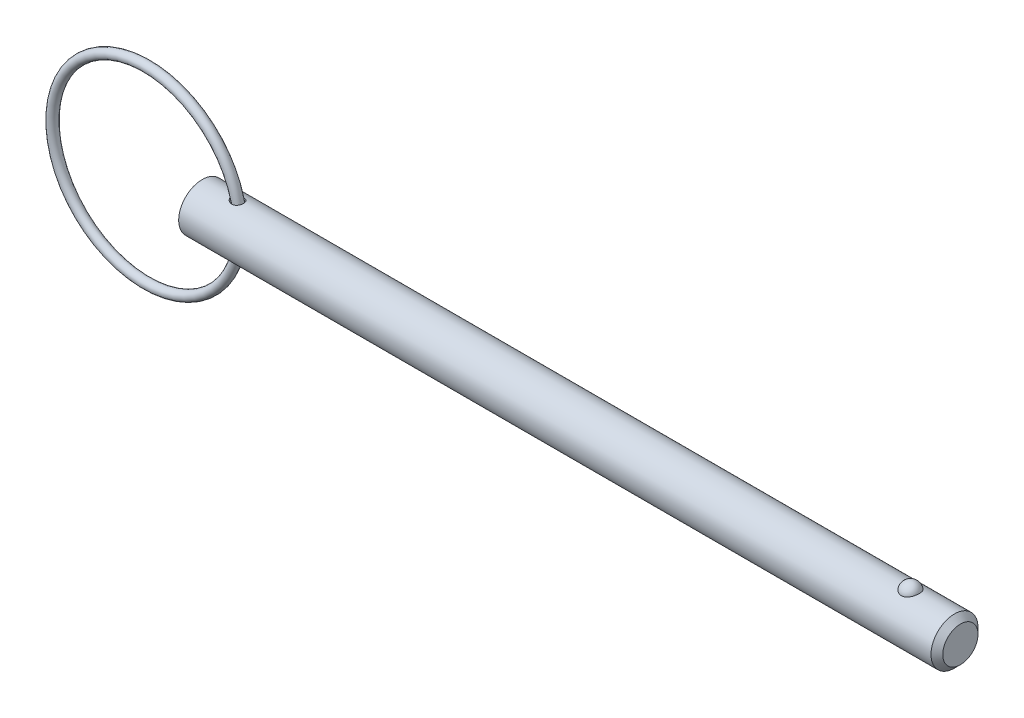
ISO-10303-21;
HEADER;
FILE_DESCRIPTION(('STEP AP214'),'2;1');
FILE_NAME('part.step','',(''),(''),'','','');
FILE_SCHEMA(('AUTOMOTIVE_DESIGN { 1 0 10303 214 1 1 1 1 }'));
ENDSEC;
DATA;
#1=APPLICATION_CONTEXT('core data for automotive mechanical design processes');
#2=APPLICATION_PROTOCOL_DEFINITION('international standard','automotive_design',2000,#1);
#3=PRODUCT_CONTEXT('',#1,'mechanical');
#4=PRODUCT('Part','Part','',(#3));
#5=PRODUCT_RELATED_PRODUCT_CATEGORY('part','',(#4));
#6=PRODUCT_DEFINITION_FORMATION('','',#4);
#7=PRODUCT_DEFINITION_CONTEXT('part definition',#1,'design');
#8=PRODUCT_DEFINITION('design','',#6,#7);
#9=PRODUCT_DEFINITION_SHAPE('','',#8);
#10=(LENGTH_UNIT() NAMED_UNIT(*) SI_UNIT(.MILLI.,.METRE.));
#11=(NAMED_UNIT(*) PLANE_ANGLE_UNIT() SI_UNIT($,.RADIAN.));
#12=(NAMED_UNIT(*) SI_UNIT($,.STERADIAN.) SOLID_ANGLE_UNIT());
#13=UNCERTAINTY_MEASURE_WITH_UNIT(LENGTH_MEASURE(1.E-05),#10,'distance_accuracy_value','');
#14=(GEOMETRIC_REPRESENTATION_CONTEXT(3) GLOBAL_UNCERTAINTY_ASSIGNED_CONTEXT((#13)) GLOBAL_UNIT_ASSIGNED_CONTEXT((#10,
#11,#12)) REPRESENTATION_CONTEXT('',''));
#15=CARTESIAN_POINT('',(0.,0.,0.));
#16=DIRECTION('',(0.,0.,1.));
#17=DIRECTION('',(1.,0.,0.));
#18=AXIS2_PLACEMENT_3D('',#15,#16,#17);
#19=CARTESIAN_POINT('',(-7.52490236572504,0.,0.));
#20=DIRECTION('',(0.,0.,1.));
#21=DIRECTION('',(1.,0.,0.));
#22=AXIS2_PLACEMENT_3D('',#19,#20,#21);
#23=TOROIDAL_SURFACE('',#22,12.7,0.635000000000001);
#24=CARTESIAN_POINT('',(5.81009763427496,0.,0.));
#25=VERTEX_POINT('',#24);
#26=VERTEX_LOOP('',#25);
#27=FACE_BOUND('',#26,.T.);
#28=ADVANCED_FACE('P0_F12',(#27),#23,.T.);
#29=CLOSED_SHELL('',(#28));
#30=MANIFOLD_SOLID_BREP('P0_B1',#29);
#31=CARTESIAN_POINT('',(0.,0.,0.));
#32=DIRECTION('',(1.,0.,0.));
#33=DIRECTION('',(0.,0.,-1.));
#34=AXIS2_PLACEMENT_3D('',#31,#32,#33);
#35=CYLINDRICAL_SURFACE('',#34,3.175);
#36=CARTESIAN_POINT('',(4.01221718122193,3.16142308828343,-0.293307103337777));
#37=CARTESIAN_POINT('',(4.03067993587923,3.15750982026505,-0.335477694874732));
#38=CARTESIAN_POINT('',(4.05297703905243,3.15289835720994,-0.375943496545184));
#39=CARTESIAN_POINT('',(4.10415276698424,3.14284099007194,-0.452407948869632));
#40=CARTESIAN_POINT('',(4.1330447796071,3.13739339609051,-0.488397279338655));
#41=CARTESIAN_POINT('',(4.19615348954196,3.12629932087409,-0.554988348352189));
#42=CARTESIAN_POINT('',(4.23034557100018,3.12065384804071,-0.585613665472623));
#43=CARTESIAN_POINT('',(4.3031328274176,3.10972452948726,-0.641123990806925));
#44=CARTESIAN_POINT('',(4.34172706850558,3.10444060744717,-0.666010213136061));
#45=CARTESIAN_POINT('',(4.42517725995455,3.09444053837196,-0.711079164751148));
#46=CARTESIAN_POINT('',(4.47028158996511,3.08978882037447,-0.730818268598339));
#47=CARTESIAN_POINT('',(4.56327045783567,3.08209858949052,-0.762602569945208));
#48=CARTESIAN_POINT('',(4.61115533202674,3.07906027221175,-0.774646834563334));
#49=CARTESIAN_POINT('',(4.70827322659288,3.0750396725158,-0.790458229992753));
#50=CARTESIAN_POINT('',(4.75750323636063,3.07405312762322,-0.79424252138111));
#51=CARTESIAN_POINT('',(4.85586074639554,3.07433427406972,-0.793155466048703));
#52=CARTESIAN_POINT('',(4.90498828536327,3.07560084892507,-0.788288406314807));
#53=CARTESIAN_POINT('',(4.99830385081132,3.08013122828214,-0.770385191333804));
#54=CARTESIAN_POINT('',(5.04260499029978,3.08325928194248,-0.757902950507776));
#55=CARTESIAN_POINT('',(5.1282462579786,3.09104671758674,-0.725486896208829));
#56=CARTESIAN_POINT('',(5.16958706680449,3.09570574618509,-0.705554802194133));
#57=CARTESIAN_POINT('',(5.24627719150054,3.10576748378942,-0.65981371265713));
#58=CARTESIAN_POINT('',(5.28181038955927,3.11112830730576,-0.634302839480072));
#59=CARTESIAN_POINT('',(5.34802604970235,3.12213947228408,-0.57766778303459));
#60=CARTESIAN_POINT('',(5.37870854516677,3.1277898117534,-0.546543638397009));
#61=CARTESIAN_POINT('',(5.43445707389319,3.13876145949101,-0.479533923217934));
#62=CARTESIAN_POINT('',(5.45951927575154,3.14408254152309,-0.443645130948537));
#63=CARTESIAN_POINT('',(5.50339935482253,3.15381660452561,-0.368122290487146));
#64=CARTESIAN_POINT('',(5.52221691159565,3.15822953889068,-0.328488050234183));
#65=CARTESIAN_POINT('',(5.55335622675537,3.16572312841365,-0.246075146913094));
#66=CARTESIAN_POINT('',(5.56559711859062,3.16878711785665,-0.203264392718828));
#67=CARTESIAN_POINT('',(5.58294807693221,3.17317503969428,-0.116135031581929));
#68=CARTESIAN_POINT('',(5.58805800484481,3.17449893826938,-0.0718163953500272));
#69=CARTESIAN_POINT('',(5.59103306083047,3.17526647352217,0.01723401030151));
#70=CARTESIAN_POINT('',(5.58887304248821,3.17470358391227,0.0619666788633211));
#71=CARTESIAN_POINT('',(5.57730300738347,3.17174350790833,0.15042284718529));
#72=CARTESIAN_POINT('',(5.56789286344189,3.16934628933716,0.1941463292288));
#73=CARTESIAN_POINT('',(5.54204285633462,3.16297605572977,0.27934466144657));
#74=CARTESIAN_POINT('',(5.52560272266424,3.15900298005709,0.320819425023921));
#75=CARTESIAN_POINT('',(5.4860820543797,3.14991364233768,0.400340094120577));
#76=CARTESIAN_POINT('',(5.46300145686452,3.14479736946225,0.438385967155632));
#77=CARTESIAN_POINT('',(5.41080575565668,3.1339965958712,0.509900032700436));
#78=CARTESIAN_POINT('',(5.3817004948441,3.12831302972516,0.54337554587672));
#79=CARTESIAN_POINT('',(5.31818122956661,3.11701107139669,0.604852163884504));
#80=CARTESIAN_POINT('',(5.2837678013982,3.11139267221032,0.632853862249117));
#81=CARTESIAN_POINT('',(5.21096127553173,3.10091904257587,0.682320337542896));
#82=CARTESIAN_POINT('',(5.1726139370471,3.09605639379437,0.703850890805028));
#83=CARTESIAN_POINT('',(5.09274050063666,3.08756769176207,0.740203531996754));
#84=CARTESIAN_POINT('',(5.05121474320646,3.08394150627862,0.755026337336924));
#85=CARTESIAN_POINT('',(4.96650658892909,3.07833156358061,0.777582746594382));
#86=CARTESIAN_POINT('',(4.92333841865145,3.07633606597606,0.785367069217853));
#87=CARTESIAN_POINT('',(4.83627503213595,3.07411756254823,0.794006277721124));
#88=CARTESIAN_POINT('',(4.79237971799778,3.07389479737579,0.794860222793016));
#89=CARTESIAN_POINT('',(4.70375644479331,3.0752087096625,0.789761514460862));
#90=CARTESIAN_POINT('',(4.65904075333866,3.07679607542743,0.783612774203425));
#91=CARTESIAN_POINT('',(4.57116325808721,3.08158486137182,0.764561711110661));
#92=CARTESIAN_POINT('',(4.52800197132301,3.08478681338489,0.751657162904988));
#93=CARTESIAN_POINT('',(4.44149370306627,3.09268658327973,0.718486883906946));
#94=CARTESIAN_POINT('',(4.39831651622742,3.0974680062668,0.697797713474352));
#95=CARTESIAN_POINT('',(4.31591226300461,3.10789270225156,0.649792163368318));
#96=CARTESIAN_POINT('',(4.27668695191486,3.11353635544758,0.622472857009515));
#97=CARTESIAN_POINT('',(4.20182407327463,3.1252888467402,0.560557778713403));
#98=CARTESIAN_POINT('',(4.16638921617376,3.13140725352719,0.525717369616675));
#99=CARTESIAN_POINT('',(4.10227951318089,3.14315144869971,0.450199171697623));
#100=CARTESIAN_POINT('',(4.0736023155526,3.14877740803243,0.409523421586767));
#101=CARTESIAN_POINT('',(4.02575866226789,3.15851130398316,0.325741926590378));
#102=CARTESIAN_POINT('',(4.00615248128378,3.16268619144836,0.282896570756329));
#103=CARTESIAN_POINT('',(3.97532986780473,3.16936826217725,0.1941636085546));
#104=CARTESIAN_POINT('',(3.96410589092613,3.17187694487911,0.148278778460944));
#105=CARTESIAN_POINT('',(3.95155037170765,3.17469339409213,0.0604600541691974));
#106=CARTESIAN_POINT('',(3.9492378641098,3.17521926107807,0.0186712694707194));
#107=CARTESIAN_POINT('',(3.95191506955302,3.1746144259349,-0.0646295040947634));
#108=CARTESIAN_POINT('',(3.9568961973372,3.17348567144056,-0.106141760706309));
#109=CARTESIAN_POINT('',(3.97060099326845,3.17043701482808,-0.172031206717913));
#110=CARTESIAN_POINT('',(3.97717137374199,3.16898333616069,-0.196902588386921));
#111=CARTESIAN_POINT('',(3.99283717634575,3.16556630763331,-0.245794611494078));
#112=CARTESIAN_POINT('',(4.00193224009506,3.16360303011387,-0.269815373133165));
#113=CARTESIAN_POINT('',(4.01221718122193,3.16142308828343,-0.293307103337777));
#114=B_SPLINE_CURVE_WITH_KNOTS('',3,(#36,#37,#38,#39,#40,#41,#42,#43,#44,#45,#46,#47,#48,#49,
#50,#51,#52,#53,#54,#55,#56,#57,#58,#59,#60,#61,#62,#63,#64,#65,#66,#67,#68,#69,#70,#71,#72,#73,
#74,#75,#76,#77,#78,#79,#80,#81,#82,#83,#84,#85,#86,#87,#88,#89,#90,#91,#92,#93,#94,#95,#96,#97,
#98,#99,#100,#101,#102,#103,#104,#105,#106,#107,#108,#109,#110,#111,#112,#113),.UNSPECIFIED.,
.T.,.F.,(4,2,2,2,2,2,2,2,2,2,2,2,2,2,2,2,2,2,2,2,2,2,2,2,2,2,2,2,2,2,2,2,2,2,2,2,2,2,4),(0.,
0.138498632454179,0.277280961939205,0.41543703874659,0.553563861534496,0.701231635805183,
0.848917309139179,0.996295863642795,1.14360140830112,1.28129260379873,1.41895203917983,
1.55053732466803,1.68212170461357,1.81379551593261,1.94547608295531,2.07874074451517,
2.21200799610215,2.34573668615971,2.47946772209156,2.61320390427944,2.74694135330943,
2.8804620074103,3.01396817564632,3.14606745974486,3.27815261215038,3.40927820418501,
3.54042159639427,3.6753294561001,3.81028178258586,3.95399377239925,4.09776931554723,
4.24721954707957,4.39661769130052,4.53771923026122,4.67869361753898,4.80361432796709,
4.92838811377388,5.00555170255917,5.08270434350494),.UNSPECIFIED.);
#115=CARTESIAN_POINT('',(4.01221718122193,3.16142308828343,-0.293307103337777));
#116=VERTEX_POINT('',#115);
#117=EDGE_CURVE('P1_E40',#116,#116,#114,.T.);
#118=ORIENTED_EDGE('',*,*,#117,.T.);
#119=EDGE_LOOP('',(#118));
#120=FACE_BOUND('',#119,.T.);
#121=CARTESIAN_POINT('',(101.61625,0.,0.));
#122=DIRECTION('',(1.,0.,0.));
#123=DIRECTION('',(0.,0.,-1.));
#124=AXIS2_PLACEMENT_3D('',#121,#122,#123);
#125=CIRCLE('',#124,3.175);
#126=CARTESIAN_POINT('',(101.61625,0.,-3.175));
#127=VERTEX_POINT('',#126);
#128=EDGE_CURVE('P1_E25',#127,#127,#125,.T.);
#129=ORIENTED_EDGE('',*,*,#128,.F.);
#130=EDGE_LOOP('',(#129));
#131=FACE_BOUND('',#130,.T.);
#132=CARTESIAN_POINT('',(0.,0.,0.));
#133=DIRECTION('',(1.,0.,0.));
#134=DIRECTION('',(0.,0.,-1.));
#135=AXIS2_PLACEMENT_3D('',#132,#133,#134);
#136=CIRCLE('',#135,3.175);
#137=CARTESIAN_POINT('',(0.,0.,-3.175));
#138=VERTEX_POINT('',#137);
#139=EDGE_CURVE('P1_E9',#138,#138,#136,.T.);
#140=ORIENTED_EDGE('',*,*,#139,.T.);
#141=EDGE_LOOP('',(#140));
#142=FACE_BOUND('',#141,.T.);
#143=CARTESIAN_POINT('',(95.6757276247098,2.92898950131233,1.2254164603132));
#144=CARTESIAN_POINT('',(95.612316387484,2.92899434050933,1.22541146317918));
#145=CARTESIAN_POINT('',(95.5487979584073,2.93112688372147,1.2203464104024));
#146=CARTESIAN_POINT('',(95.4235306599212,2.93942752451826,1.20020949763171));
#147=CARTESIAN_POINT('',(95.3617869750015,2.9456063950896,1.1851109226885));
#148=CARTESIAN_POINT('',(95.2420651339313,2.96127115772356,1.14540352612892));
#149=CARTESIAN_POINT('',(95.1840775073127,2.97074831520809,1.12081980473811));
#150=CARTESIAN_POINT('',(95.0731943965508,2.99197584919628,1.06285154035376));
#151=CARTESIAN_POINT('',(95.0202966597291,3.0037252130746,1.02947091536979));
#152=CARTESIAN_POINT('',(94.9192688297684,3.02865714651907,0.953674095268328));
#153=CARTESIAN_POINT('',(94.8713240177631,3.04187163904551,0.91102165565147));
#154=CARTESIAN_POINT('',(94.7830360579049,3.06808741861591,0.818400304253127));
#155=CARTESIAN_POINT('',(94.7426952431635,3.08108863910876,0.768429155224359));
#156=CARTESIAN_POINT('',(94.6688039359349,3.10614903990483,0.660064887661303));
#157=CARTESIAN_POINT('',(94.6356330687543,3.11814104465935,0.601396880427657));
#158=CARTESIAN_POINT('',(94.5791190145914,3.13926931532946,0.47902691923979));
#159=CARTESIAN_POINT('',(94.5557764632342,3.14840539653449,0.415324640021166));
#160=CARTESIAN_POINT('',(94.5191785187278,3.16298160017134,0.283885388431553));
#161=CARTESIAN_POINT('',(94.5060407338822,3.16837855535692,0.216110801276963));
#162=CARTESIAN_POINT('',(94.4905676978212,3.17475386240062,0.0791367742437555));
#163=CARTESIAN_POINT('',(94.488232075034,3.17573236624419,0.00993738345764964));
#164=CARTESIAN_POINT('',(94.4943886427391,3.17318075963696,-0.127420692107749));
#165=CARTESIAN_POINT('',(94.5028073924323,3.16968122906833,-0.195583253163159));
#166=CARTESIAN_POINT('',(94.5301752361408,3.1585790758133,-0.329413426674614));
#167=CARTESIAN_POINT('',(94.5491245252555,3.15097637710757,-0.395080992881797));
#168=CARTESIAN_POINT('',(94.5972057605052,3.13242485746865,-0.522180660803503));
#169=CARTESIAN_POINT('',(94.6263524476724,3.12147119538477,-0.583606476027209));
#170=CARTESIAN_POINT('',(94.6942352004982,3.09734973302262,-0.700436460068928));
#171=CARTESIAN_POINT('',(94.732972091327,3.08418174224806,-0.755840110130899));
#172=CARTESIAN_POINT('',(94.8194771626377,3.05694884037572,-0.859404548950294));
#173=CARTESIAN_POINT('',(94.8672961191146,3.04287919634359,-0.907521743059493));
#174=CARTESIAN_POINT('',(94.9707353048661,3.01548927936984,-0.994758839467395));
#175=CARTESIAN_POINT('',(95.0263549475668,3.00216895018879,-1.03387941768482));
#176=CARTESIAN_POINT('',(95.1428093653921,2.97810316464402,-1.10126594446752));
#177=CARTESIAN_POINT('',(95.2035182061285,2.96731170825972,-1.12973256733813));
#178=CARTESIAN_POINT('',(95.3293712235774,2.94928934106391,-1.17598467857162));
#179=CARTESIAN_POINT('',(95.3945137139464,2.94205708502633,-1.19377420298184));
#180=CARTESIAN_POINT('',(95.5238562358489,2.93233065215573,-1.21746387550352));
#181=CARTESIAN_POINT('',(95.5879385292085,2.92961621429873,-1.22391763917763));
#182=CARTESIAN_POINT('',(95.7163375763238,2.92855752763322,-1.22644976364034));
#183=CARTESIAN_POINT('',(95.7806542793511,2.93021238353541,-1.22253024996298));
#184=CARTESIAN_POINT('',(95.9055239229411,2.9375685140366,-1.20474140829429));
#185=CARTESIAN_POINT('',(95.966131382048,2.94313790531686,-1.19119621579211));
#186=CARTESIAN_POINT('',(96.0841106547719,2.95756226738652,-1.15491492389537));
#187=CARTESIAN_POINT('',(96.1414822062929,2.96641750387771,-1.13217808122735));
#188=CARTESIAN_POINT('',(96.2527699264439,2.98669918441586,-1.07755083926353));
#189=CARTESIAN_POINT('',(96.3065845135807,2.9981771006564,-1.0454730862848));
#190=CARTESIAN_POINT('',(96.4081473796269,3.02240235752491,-0.973220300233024));
#191=CARTESIAN_POINT('',(96.4558942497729,3.03514999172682,-0.933043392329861));
#192=CARTESIAN_POINT('',(96.5465817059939,3.06131230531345,-0.843372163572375));
#193=CARTESIAN_POINT('',(96.5891588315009,3.07472822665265,-0.79351033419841));
#194=CARTESIAN_POINT('',(96.6656765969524,3.10021106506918,-0.687241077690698));
#195=CARTESIAN_POINT('',(96.6996156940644,3.1122777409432,-0.630832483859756));
#196=CARTESIAN_POINT('',(96.7591209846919,3.134208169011,-0.511059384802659));
#197=CARTESIAN_POINT('',(96.7843892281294,3.14399040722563,-0.447531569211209));
#198=CARTESIAN_POINT('',(96.8245117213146,3.15983820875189,-0.316827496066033));
#199=CARTESIAN_POINT('',(96.8393659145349,3.16590375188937,-0.249651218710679));
#200=CARTESIAN_POINT('',(96.858358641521,3.17370076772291,-0.113549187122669));
#201=CARTESIAN_POINT('',(96.8624966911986,3.17543204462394,-0.0446233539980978));
#202=CARTESIAN_POINT('',(96.8599697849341,3.17438372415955,0.0929938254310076));
#203=CARTESIAN_POINT('',(96.8533050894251,3.17160423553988,0.161685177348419));
#204=CARTESIAN_POINT('',(96.8293754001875,3.1618438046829,0.296502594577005));
#205=CARTESIAN_POINT('',(96.8121674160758,3.15488546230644,0.36264043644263));
#206=CARTESIAN_POINT('',(96.767547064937,3.13748892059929,0.490896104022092));
#207=CARTESIAN_POINT('',(96.7401339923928,3.12705048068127,0.553013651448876));
#208=CARTESIAN_POINT('',(96.6754626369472,3.10369139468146,0.671876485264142));
#209=CARTESIAN_POINT('',(96.6381467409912,3.0907563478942,0.728587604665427));
#210=CARTESIAN_POINT('',(96.5545246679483,3.06381731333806,0.834653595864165));
#211=CARTESIAN_POINT('',(96.5082189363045,3.04981337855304,0.884008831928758));
#212=CARTESIAN_POINT('',(96.407718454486,3.02230423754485,0.97391679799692));
#213=CARTESIAN_POINT('',(96.353535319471,3.00879833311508,1.01448227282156));
#214=CARTESIAN_POINT('',(96.2385299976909,2.98383625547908,1.0857155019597));
#215=CARTESIAN_POINT('',(96.1777053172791,2.9723808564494,1.11637952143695));
#216=CARTESIAN_POINT('',(96.0533690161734,2.95329063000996,1.16592590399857));
#217=CARTESIAN_POINT('',(95.9900230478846,2.9455373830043,1.18517901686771));
#218=CARTESIAN_POINT('',(95.8607664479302,2.9342556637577,1.21284802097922));
#219=CARTESIAN_POINT('',(95.7948641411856,2.93071450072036,1.2212964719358));
#220=CARTESIAN_POINT('',(95.711116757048,2.9291525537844,1.22502505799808));
#221=CARTESIAN_POINT('',(95.6934263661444,2.92898815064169,1.22541785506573));
#222=CARTESIAN_POINT('',(95.6757276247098,2.92898950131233,1.2254164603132));
#223=B_SPLINE_CURVE_WITH_KNOTS('',3,(#143,#144,#145,#146,#147,#148,#149,#150,#151,#152,#153,
#154,#155,#156,#157,#158,#159,#160,#161,#162,#163,#164,#165,#166,#167,#168,#169,#170,#171,#172,
#173,#174,#175,#176,#177,#178,#179,#180,#181,#182,#183,#184,#185,#186,#187,#188,#189,#190,#191,
#192,#193,#194,#195,#196,#197,#198,#199,#200,#201,#202,#203,#204,#205,#206,#207,#208,#209,#210,
#211,#212,#213,#214,#215,#216,#217,#218,#219,#220,#221,#222),.UNSPECIFIED.,.T.,.F.,(4,2,2,2,2,2,
2,2,2,2,2,2,2,2,2,2,2,2,2,2,2,2,2,2,2,2,2,2,2,2,2,2,2,2,2,2,2,2,2,4),(0.,0.190186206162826,
0.380880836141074,0.571074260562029,0.761183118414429,0.956866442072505,1.15260970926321,
1.35701770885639,1.56143892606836,1.76818248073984,1.97491892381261,2.18025109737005,
2.38558707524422,2.59122111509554,2.79687285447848,3.00371012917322,3.21053185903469,
3.41323429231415,3.61586005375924,3.80828192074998,4.00066436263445,4.18685798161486,
4.37306665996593,4.56330302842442,4.75358348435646,4.95345287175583,5.15335793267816,
5.35957003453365,5.56578325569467,5.7720057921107,5.97822335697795,6.18333558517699,
6.38846199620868,6.59480900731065,6.80114579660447,7.00718137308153,7.21329457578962,
7.41228022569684,7.61066481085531,7.66374777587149),.UNSPECIFIED.);
#224=CARTESIAN_POINT('',(95.6757276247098,2.92898950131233,1.2254164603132));
#225=VERTEX_POINT('',#224);
#226=EDGE_CURVE('P1_E34',#225,#225,#223,.T.);
#227=ORIENTED_EDGE('',*,*,#226,.T.);
#228=EDGE_LOOP('',(#227));
#229=FACE_BOUND('',#228,.T.);
#230=CARTESIAN_POINT('',(4.01221718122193,-3.16142308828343,-0.293307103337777));
#231=CARTESIAN_POINT('',(3.99616924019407,-3.16482429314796,-0.256648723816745));
#232=CARTESIAN_POINT('',(3.9830087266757,-3.16769953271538,-0.218679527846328));
#233=CARTESIAN_POINT('',(3.96305928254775,-3.17210414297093,-0.141027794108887));
#234=CARTESIAN_POINT('',(3.95626715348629,-3.17363418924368,-0.101346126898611));
#235=CARTESIAN_POINT('',(3.94940055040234,-3.17518116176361,-0.0213063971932));
#236=CARTESIAN_POINT('',(3.94933713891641,-3.17519559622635,0.0190526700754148));
#237=CARTESIAN_POINT('',(3.95595884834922,-3.173703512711,0.0991848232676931));
#238=CARTESIAN_POINT('',(3.96264478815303,-3.17219681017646,0.138957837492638));
#239=CARTESIAN_POINT('',(3.98225001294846,-3.16786598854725,0.216153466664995));
#240=CARTESIAN_POINT('',(3.99506606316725,-3.16506371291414,0.253603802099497));
#241=CARTESIAN_POINT('',(4.0263107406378,-3.15843101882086,0.325977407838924));
#242=CARTESIAN_POINT('',(4.04474073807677,-3.15460034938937,0.360900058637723));
#243=CARTESIAN_POINT('',(4.0879644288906,-3.14597426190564,0.429836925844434));
#244=CARTESIAN_POINT('',(4.1131071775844,-3.1411307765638,0.463625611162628));
#245=CARTESIAN_POINT('',(4.16818460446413,-3.13112506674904,0.526983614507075));
#246=CARTESIAN_POINT('',(4.1981214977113,-3.1259626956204,0.556550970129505));
#247=CARTESIAN_POINT('',(4.26550089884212,-3.11521604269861,0.614003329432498));
#248=CARTESIAN_POINT('',(4.3034063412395,-3.10964747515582,0.641349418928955));
#249=CARTESIAN_POINT('',(4.38313680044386,-3.09926692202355,0.68977116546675));
#250=CARTESIAN_POINT('',(4.42496355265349,-3.09445527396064,0.710844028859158));
#251=CARTESIAN_POINT('',(4.51417855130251,-3.08586578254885,0.747282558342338));
#252=CARTESIAN_POINT('',(4.56175044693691,-3.08216903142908,0.762221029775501));
#253=CARTESIAN_POINT('',(4.6588493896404,-3.076742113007,0.783842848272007));
#254=CARTESIAN_POINT('',(4.70837600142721,-3.07501151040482,0.790528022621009));
#255=CARTESIAN_POINT('',(4.80630979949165,-3.07383938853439,0.7950736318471));
#256=CARTESIAN_POINT('',(4.85470314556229,-3.07432752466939,0.793205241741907));
#257=CARTESIAN_POINT('',(4.95034305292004,-3.07744489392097,0.781023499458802));
#258=CARTESIAN_POINT('',(4.99759012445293,-3.0800731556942,0.770713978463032));
#259=CARTESIAN_POINT('',(5.08626194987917,-3.08693276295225,0.742738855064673));
#260=CARTESIAN_POINT('',(5.1278649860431,-3.09104603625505,0.725607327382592));
#261=CARTESIAN_POINT('',(5.20739903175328,-3.10040746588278,0.684500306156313));
#262=CARTESIAN_POINT('',(5.24533051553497,-3.10565547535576,0.660525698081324));
#263=CARTESIAN_POINT('',(5.31542898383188,-3.11652031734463,0.607160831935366));
#264=CARTESIAN_POINT('',(5.34772618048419,-3.12212297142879,0.577938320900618));
#265=CARTESIAN_POINT('',(5.40696901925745,-3.13320503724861,0.51447712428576));
#266=CARTESIAN_POINT('',(5.43391452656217,-3.13868444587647,0.48023831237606));
#267=CARTESIAN_POINT('',(5.4820017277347,-3.14897211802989,0.407384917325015));
#268=CARTESIAN_POINT('',(5.50309185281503,-3.15377424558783,0.368735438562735));
#269=CARTESIAN_POINT('',(5.53866240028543,-3.16213411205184,0.288380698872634));
#270=CARTESIAN_POINT('',(5.55314252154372,-3.16569179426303,0.246675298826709));
#271=CARTESIAN_POINT('',(5.57526489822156,-3.17121134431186,0.160950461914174));
#272=CARTESIAN_POINT('',(5.58283917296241,-3.17315732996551,0.116912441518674));
#273=CARTESIAN_POINT('',(5.59072863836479,-3.17518554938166,0.0281485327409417));
#274=CARTESIAN_POINT('',(5.59104374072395,-3.17526776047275,-0.016577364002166));
#275=CARTESIAN_POINT('',(5.58440302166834,-3.17355847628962,-0.105510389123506));
#276=CARTESIAN_POINT('',(5.57743745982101,-3.17176447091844,-0.149716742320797));
#277=CARTESIAN_POINT('',(5.55638330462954,-3.16649194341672,-0.23629572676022));
#278=CARTESIAN_POINT('',(5.54229454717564,-3.16301338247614,-0.278668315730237));
#279=CARTESIAN_POINT('',(5.50732506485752,-3.15474878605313,-0.360378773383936));
#280=CARTESIAN_POINT('',(5.48644386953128,-3.14996266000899,-0.399716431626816));
#281=CARTESIAN_POINT('',(5.43839310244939,-3.13960947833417,-0.47422997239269));
#282=CARTESIAN_POINT('',(5.41122365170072,-3.1340424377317,-0.509405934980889));
#283=CARTESIAN_POINT('',(5.35140258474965,-3.12277449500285,-0.574449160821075));
#284=CARTESIAN_POINT('',(5.31877354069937,-3.11707422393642,-0.604337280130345));
#285=CARTESIAN_POINT('',(5.24883067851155,-3.10616541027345,-0.658116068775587));
#286=CARTESIAN_POINT('',(5.21151752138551,-3.1009567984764,-0.682007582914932));
#287=CARTESIAN_POINT('',(5.13375489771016,-3.09168295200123,-0.722881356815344));
#288=CARTESIAN_POINT('',(5.09335030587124,-3.0876042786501,-0.739946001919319));
#289=CARTESIAN_POINT('',(5.0101742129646,-3.08094605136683,-0.767199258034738));
#290=CARTESIAN_POINT('',(4.96740279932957,-3.07836644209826,-0.777388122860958));
#291=CARTESIAN_POINT('',(4.88066362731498,-3.07495302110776,-0.790782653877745));
#292=CARTESIAN_POINT('',(4.8366943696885,-3.07412150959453,-0.793979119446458));
#293=CARTESIAN_POINT('',(4.74880185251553,-3.07424620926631,-0.793495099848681));
#294=CARTESIAN_POINT('',(4.70487860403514,-3.07520278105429,-0.789813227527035));
#295=CARTESIAN_POINT('',(4.61626456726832,-3.07882608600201,-0.775571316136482));
#296=CARTESIAN_POINT('',(4.571624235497,-3.08156578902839,-0.764717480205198));
#297=CARTESIAN_POINT('',(4.48464592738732,-3.08847909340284,-0.736297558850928));
#298=CARTESIAN_POINT('',(4.44230893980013,-3.09265330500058,-0.718728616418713));
#299=CARTESIAN_POINT('',(4.35823256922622,-3.10228551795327,-0.675988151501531));
#300=CARTESIAN_POINT('',(4.31671586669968,-3.10780992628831,-0.650392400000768));
#301=CARTESIAN_POINT('',(4.23853942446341,-3.11932897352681,-0.592684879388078));
#302=CARTESIAN_POINT('',(4.20188053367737,-3.12532369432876,-0.560571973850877));
#303=CARTESIAN_POINT('',(4.13583653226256,-3.13687565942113,-0.491740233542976));
#304=CARTESIAN_POINT('',(4.10623659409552,-3.14244088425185,-0.455229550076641));
#305=CARTESIAN_POINT('',(4.05384351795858,-3.1527191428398,-0.377513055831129));
#306=CARTESIAN_POINT('',(4.03104346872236,-3.1574330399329,-0.336312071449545));
#307=CARTESIAN_POINT('',(4.01221718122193,-3.16142308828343,-0.293307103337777));
#308=B_SPLINE_CURVE_WITH_KNOTS('',3,(#230,#231,#232,#233,#234,#235,#236,#237,#238,#239,#240,
#241,#242,#243,#244,#245,#246,#247,#248,#249,#250,#251,#252,#253,#254,#255,#256,#257,#258,#259,
#260,#261,#262,#263,#264,#265,#266,#267,#268,#269,#270,#271,#272,#273,#274,#275,#276,#277,#278,
#279,#280,#281,#282,#283,#284,#285,#286,#287,#288,#289,#290,#291,#292,#293,#294,#295,#296,#297,
#298,#299,#300,#301,#302,#303,#304,#305,#306,#307),.UNSPECIFIED.,.T.,.F.,(4,2,2,2,2,2,2,2,2,2,2,
2,2,2,2,2,2,2,2,2,2,2,2,2,2,2,2,2,2,2,2,2,2,2,2,2,2,2,4),(0.,0.120338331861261,
0.240616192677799,0.361091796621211,0.481582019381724,0.600110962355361,0.718668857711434,
0.845336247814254,0.972062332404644,1.1126676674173,1.25333552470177,1.40259505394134,
1.55182153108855,1.69635040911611,1.84081372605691,1.97568175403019,2.11053233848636,
2.24166080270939,2.37279256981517,2.50504501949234,2.63730349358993,2.77085027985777,
2.90439869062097,3.03812599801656,3.17185638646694,3.30559603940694,3.43933311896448,
3.57253035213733,3.70570880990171,3.83722775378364,3.96874184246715,4.10042887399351,
4.23214246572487,4.36961700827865,4.5071501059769,4.65373408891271,4.8003436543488,
4.94166003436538,5.08283228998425),.UNSPECIFIED.);
#309=CARTESIAN_POINT('',(4.01221718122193,-3.16142308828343,-0.293307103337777));
#310=VERTEX_POINT('',#309);
#311=EDGE_CURVE('P1_E17',#310,#310,#308,.T.);
#312=ORIENTED_EDGE('',*,*,#311,.T.);
#313=EDGE_LOOP('',(#312));
#314=FACE_BOUND('',#313,.T.);
#315=ADVANCED_FACE('P1_F13',(#120,#131,#142,#229,#314),#35,.T.);
#316=CARTESIAN_POINT('',(0.,0.,0.));
#317=DIRECTION('',(-1.,0.,0.));
#318=DIRECTION('',(0.,0.,1.));
#319=AXIS2_PLACEMENT_3D('',#316,#317,#318);
#320=PLANE('',#319);
#321=ORIENTED_EDGE('',*,*,#139,.F.);
#322=EDGE_LOOP('',(#321));
#323=FACE_BOUND('',#322,.T.);
#324=ADVANCED_FACE('P1_F15',(#323),#320,.T.);
#325=CARTESIAN_POINT('',(102.41,0.,0.));
#326=DIRECTION('',(-1.,0.,0.));
#327=DIRECTION('',(0.,0.,1.));
#328=AXIS2_PLACEMENT_3D('',#325,#326,#327);
#329=CONICAL_SURFACE('',#328,2.38125000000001,0.785398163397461);
#330=ORIENTED_EDGE('',*,*,#128,.T.);
#331=EDGE_LOOP('',(#330));
#332=FACE_BOUND('',#331,.T.);
#333=CARTESIAN_POINT('',(102.41,0.,0.));
#334=DIRECTION('',(1.,0.,0.));
#335=DIRECTION('',(0.,0.,-1.));
#336=AXIS2_PLACEMENT_3D('',#333,#334,#335);
#337=CIRCLE('',#336,2.38125000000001);
#338=CARTESIAN_POINT('',(102.41,0.,-2.38125000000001));
#339=VERTEX_POINT('',#338);
#340=EDGE_CURVE('P1_E30',#339,#339,#337,.T.);
#341=ORIENTED_EDGE('',*,*,#340,.F.);
#342=EDGE_LOOP('',(#341));
#343=FACE_BOUND('',#342,.T.);
#344=ADVANCED_FACE('P1_F55',(#332,#343),#329,.T.);
#345=CARTESIAN_POINT('',(102.41,2.38125000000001,0.));
#346=DIRECTION('',(1.,0.,0.));
#347=DIRECTION('',(0.,0.,-1.));
#348=AXIS2_PLACEMENT_3D('',#345,#346,#347);
#349=PLANE('',#348);
#350=ORIENTED_EDGE('',*,*,#340,.T.);
#351=EDGE_LOOP('',(#350));
#352=FACE_BOUND('',#351,.T.);
#353=ADVANCED_FACE('P1_F51',(#352),#349,.T.);
#354=CARTESIAN_POINT('',(95.6757276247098,2.8575,0.));
#355=DIRECTION('',(-1.,0.,0.));
#356=DIRECTION('',(0.,1.,0.));
#357=AXIS2_PLACEMENT_3D('',#354,#355,#356);
#358=SPHERICAL_SURFACE('',#357,1.22750000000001);
#359=ORIENTED_EDGE('',*,*,#226,.F.);
#360=EDGE_LOOP('',(#359));
#361=FACE_BOUND('',#360,.T.);
#362=ADVANCED_FACE('P1_F46',(#361),#358,.T.);
#363=CARTESIAN_POINT('',(-7.52490236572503,0.,0.));
#364=DIRECTION('',(0.,0.,1.));
#365=DIRECTION('',(1.,0.,0.));
#366=AXIS2_PLACEMENT_3D('',#363,#364,#365);
#367=TOROIDAL_SURFACE('',#366,12.7,0.79375);
#368=ORIENTED_EDGE('',*,*,#311,.F.);
#369=EDGE_LOOP('',(#368));
#370=FACE_BOUND('',#369,.T.);
#371=ORIENTED_EDGE('',*,*,#117,.F.);
#372=EDGE_LOOP('',(#371));
#373=FACE_BOUND('',#372,.T.);
#374=ADVANCED_FACE('P1_F50',(#370,#373),#367,.F.);
#375=CLOSED_SHELL('',(#315,#324,#344,#353,#362,#374));
#376=MANIFOLD_SOLID_BREP('P1_B1',#375);
#377=ADVANCED_BREP_SHAPE_REPRESENTATION('',(#18,#30,#376),#14);
#378=SHAPE_DEFINITION_REPRESENTATION(#9,#377);
ENDSEC;
END-ISO-10303-21;
